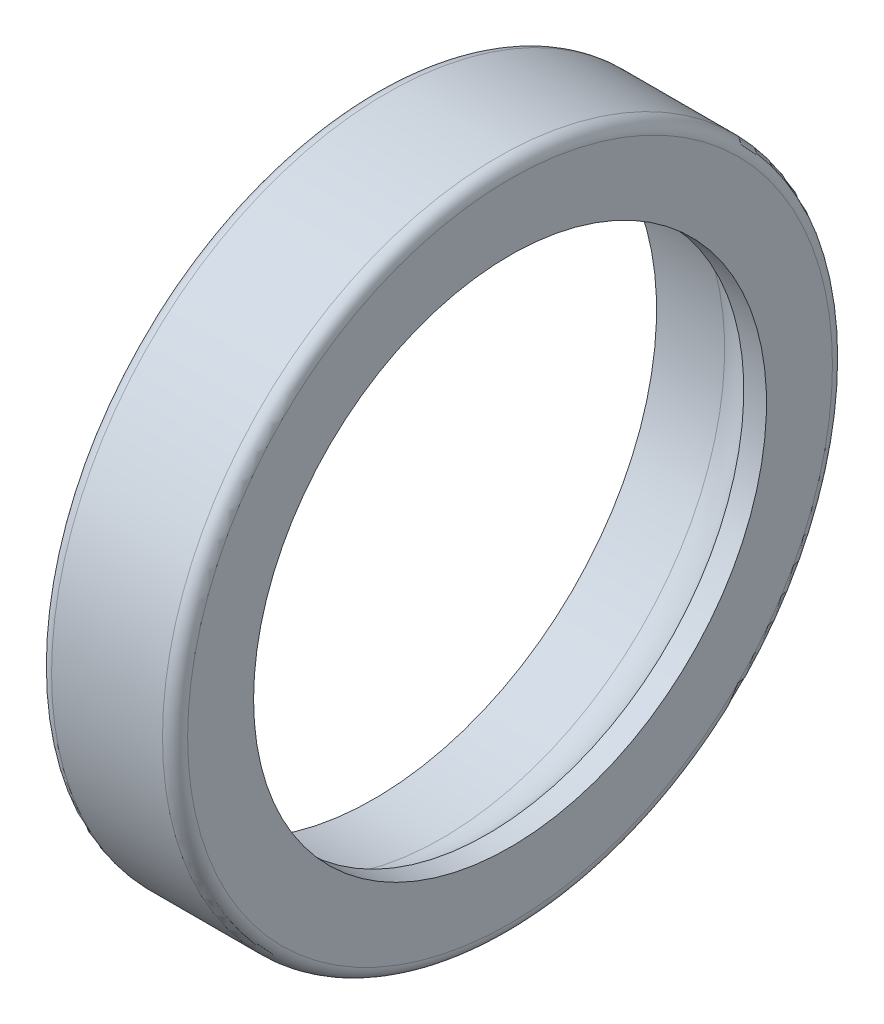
ISO-10303-21;
HEADER;
FILE_DESCRIPTION(('STEP AP214'),'2;1');
FILE_NAME('part.step','',(''),(''),'','','');
FILE_SCHEMA(('AUTOMOTIVE_DESIGN { 1 0 10303 214 1 1 1 1 }'));
ENDSEC;
DATA;
#1=APPLICATION_CONTEXT('core data for automotive mechanical design processes');
#2=APPLICATION_PROTOCOL_DEFINITION('international standard','automotive_design',2000,#1);
#3=PRODUCT_CONTEXT('',#1,'mechanical');
#4=PRODUCT('Part','Part','',(#3));
#5=PRODUCT_RELATED_PRODUCT_CATEGORY('part','',(#4));
#6=PRODUCT_DEFINITION_FORMATION('','',#4);
#7=PRODUCT_DEFINITION_CONTEXT('part definition',#1,'design');
#8=PRODUCT_DEFINITION('design','',#6,#7);
#9=PRODUCT_DEFINITION_SHAPE('','',#8);
#10=(LENGTH_UNIT() NAMED_UNIT(*) SI_UNIT(.MILLI.,.METRE.));
#11=(NAMED_UNIT(*) PLANE_ANGLE_UNIT() SI_UNIT($,.RADIAN.));
#12=(NAMED_UNIT(*) SI_UNIT($,.STERADIAN.) SOLID_ANGLE_UNIT());
#13=UNCERTAINTY_MEASURE_WITH_UNIT(LENGTH_MEASURE(1.E-05),#10,'distance_accuracy_value','');
#14=(GEOMETRIC_REPRESENTATION_CONTEXT(3) GLOBAL_UNCERTAINTY_ASSIGNED_CONTEXT((#13)) GLOBAL_UNIT_ASSIGNED_CONTEXT((#10,
#11,#12)) REPRESENTATION_CONTEXT('',''));
#15=CARTESIAN_POINT('',(0.,0.,0.));
#16=DIRECTION('',(0.,0.,1.));
#17=DIRECTION('',(1.,0.,0.));
#18=AXIS2_PLACEMENT_3D('',#15,#16,#17);
#19=CARTESIAN_POINT('',(5.,0.,0.));
#20=DIRECTION('',(-1.,0.,0.));
#21=DIRECTION('',(0.,0.,1.));
#22=AXIS2_PLACEMENT_3D('',#19,#20,#21);
#23=TOROIDAL_SURFACE('',#22,11.,2.5);
#24=CARTESIAN_POINT('',(7.1650635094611,0.,0.));
#25=DIRECTION('',(-1.,0.,0.));
#26=DIRECTION('',(0.,0.,1.));
#27=AXIS2_PLACEMENT_3D('',#24,#25,#26);
#28=CIRCLE('',#27,12.25);
#29=CARTESIAN_POINT('',(7.1650635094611,0.,12.25));
#30=VERTEX_POINT('',#29);
#31=EDGE_CURVE('E10',#30,#30,#28,.T.);
#32=ORIENTED_EDGE('',*,*,#31,.F.);
#33=EDGE_LOOP('',(#32));
#34=FACE_BOUND('',#33,.T.);
#35=CARTESIAN_POINT('',(5.,0.,0.));
#36=DIRECTION('',(-1.,0.,0.));
#37=DIRECTION('',(0.,0.,1.));
#38=AXIS2_PLACEMENT_3D('',#35,#36,#37);
#39=CIRCLE('',#38,13.5);
#40=CARTESIAN_POINT('',(5.,0.,13.5));
#41=VERTEX_POINT('',#40);
#42=EDGE_CURVE('E57',#41,#41,#39,.T.);
#43=ORIENTED_EDGE('',*,*,#42,.T.);
#44=EDGE_LOOP('',(#43));
#45=FACE_BOUND('',#44,.T.);
#46=ADVANCED_FACE('F29',(#34,#45),#23,.F.);
#47=CARTESIAN_POINT('',(0.,0.,0.));
#48=DIRECTION('',(-1.,0.,0.));
#49=DIRECTION('',(0.,0.,1.));
#50=AXIS2_PLACEMENT_3D('',#47,#48,#49);
#51=CYLINDRICAL_SURFACE('',#50,12.25);
#52=CARTESIAN_POINT('',(8.25,0.,0.));
#53=DIRECTION('',(-1.,0.,0.));
#54=DIRECTION('',(0.,0.,1.));
#55=AXIS2_PLACEMENT_3D('',#52,#53,#54);
#56=CIRCLE('',#55,12.25);
#57=CARTESIAN_POINT('',(8.25,0.,12.25));
#58=VERTEX_POINT('',#57);
#59=EDGE_CURVE('E35',#58,#58,#56,.T.);
#60=ORIENTED_EDGE('',*,*,#59,.F.);
#61=EDGE_LOOP('',(#60));
#62=FACE_BOUND('',#61,.T.);
#63=ORIENTED_EDGE('',*,*,#31,.T.);
#64=EDGE_LOOP('',(#63));
#65=FACE_BOUND('',#64,.T.);
#66=ADVANCED_FACE('F94',(#62,#65),#51,.F.);
#67=CARTESIAN_POINT('',(8.25,0.,-15.4));
#68=DIRECTION('',(-1.,0.,0.));
#69=DIRECTION('',(0.,0.,1.));
#70=AXIS2_PLACEMENT_3D('',#67,#68,#69);
#71=PLANE('',#70);
#72=CARTESIAN_POINT('',(8.25,0.,0.));
#73=DIRECTION('',(-1.,0.,0.));
#74=DIRECTION('',(0.,0.,1.));
#75=AXIS2_PLACEMENT_3D('',#72,#73,#74);
#76=CIRCLE('',#75,15.4);
#77=CARTESIAN_POINT('',(8.25,0.,15.4));
#78=VERTEX_POINT('',#77);
#79=EDGE_CURVE('E39',#78,#78,#76,.T.);
#80=ORIENTED_EDGE('',*,*,#79,.F.);
#81=EDGE_LOOP('',(#80));
#82=FACE_BOUND('',#81,.T.);
#83=ORIENTED_EDGE('',*,*,#59,.T.);
#84=EDGE_LOOP('',(#83));
#85=FACE_BOUND('',#84,.T.);
#86=ADVANCED_FACE('F89',(#82,#85),#71,.F.);
#87=CARTESIAN_POINT('',(7.65,0.,0.));
#88=DIRECTION('',(-1.,0.,0.));
#89=DIRECTION('',(0.,0.,1.));
#90=AXIS2_PLACEMENT_3D('',#87,#88,#89);
#91=TOROIDAL_SURFACE('',#90,15.4,0.6);
#92=CARTESIAN_POINT('',(7.65,0.,0.));
#93=DIRECTION('',(-1.,0.,0.));
#94=DIRECTION('',(0.,0.,1.));
#95=AXIS2_PLACEMENT_3D('',#92,#93,#94);
#96=CIRCLE('',#95,16.);
#97=CARTESIAN_POINT('',(7.65,0.,16.));
#98=VERTEX_POINT('',#97);
#99=EDGE_CURVE('E43',#98,#98,#96,.T.);
#100=ORIENTED_EDGE('',*,*,#99,.F.);
#101=EDGE_LOOP('',(#100));
#102=FACE_BOUND('',#101,.T.);
#103=ORIENTED_EDGE('',*,*,#79,.T.);
#104=EDGE_LOOP('',(#103));
#105=FACE_BOUND('',#104,.T.);
#106=ADVANCED_FACE('F83',(#102,#105),#91,.T.);
#107=CARTESIAN_POINT('',(0.,0.,0.));
#108=DIRECTION('',(-1.,0.,0.));
#109=DIRECTION('',(0.,0.,1.));
#110=AXIS2_PLACEMENT_3D('',#107,#108,#109);
#111=CYLINDRICAL_SURFACE('',#110,16.);
#112=CARTESIAN_POINT('',(2.35000000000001,0.,0.));
#113=DIRECTION('',(-1.,0.,0.));
#114=DIRECTION('',(0.,0.,1.));
#115=AXIS2_PLACEMENT_3D('',#112,#113,#114);
#116=CIRCLE('',#115,16.);
#117=CARTESIAN_POINT('',(2.35000000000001,0.,16.));
#118=VERTEX_POINT('',#117);
#119=EDGE_CURVE('E48',#118,#118,#116,.T.);
#120=ORIENTED_EDGE('',*,*,#119,.F.);
#121=EDGE_LOOP('',(#120));
#122=FACE_BOUND('',#121,.T.);
#123=ORIENTED_EDGE('',*,*,#99,.T.);
#124=EDGE_LOOP('',(#123));
#125=FACE_BOUND('',#124,.T.);
#126=ADVANCED_FACE('F77',(#122,#125),#111,.T.);
#127=CARTESIAN_POINT('',(2.35,0.,0.));
#128=DIRECTION('',(-1.,0.,0.));
#129=DIRECTION('',(0.,0.,1.));
#130=AXIS2_PLACEMENT_3D('',#127,#128,#129);
#131=TOROIDAL_SURFACE('',#130,15.4,0.6);
#132=CARTESIAN_POINT('',(1.75,0.,0.));
#133=DIRECTION('',(-1.,0.,0.));
#134=DIRECTION('',(0.,0.,1.));
#135=AXIS2_PLACEMENT_3D('',#132,#133,#134);
#136=CIRCLE('',#135,15.4);
#137=CARTESIAN_POINT('',(1.75,0.,15.4));
#138=VERTEX_POINT('',#137);
#139=EDGE_CURVE('E51',#138,#138,#136,.T.);
#140=ORIENTED_EDGE('',*,*,#139,.F.);
#141=EDGE_LOOP('',(#140));
#142=FACE_BOUND('',#141,.T.);
#143=ORIENTED_EDGE('',*,*,#119,.T.);
#144=EDGE_LOOP('',(#143));
#145=FACE_BOUND('',#144,.T.);
#146=ADVANCED_FACE('F71',(#142,#145),#131,.T.);
#147=CARTESIAN_POINT('',(1.75,0.,-15.4));
#148=DIRECTION('',(1.,0.,0.));
#149=DIRECTION('',(0.,0.,-1.));
#150=AXIS2_PLACEMENT_3D('',#147,#148,#149);
#151=PLANE('',#150);
#152=CARTESIAN_POINT('',(1.75,0.,0.));
#153=DIRECTION('',(-1.,0.,0.));
#154=DIRECTION('',(0.,0.,1.));
#155=AXIS2_PLACEMENT_3D('',#152,#153,#154);
#156=CIRCLE('',#155,13.5);
#157=CARTESIAN_POINT('',(1.75,0.,13.5));
#158=VERTEX_POINT('',#157);
#159=EDGE_CURVE('E54',#158,#158,#156,.T.);
#160=ORIENTED_EDGE('',*,*,#159,.F.);
#161=EDGE_LOOP('',(#160));
#162=FACE_BOUND('',#161,.T.);
#163=ORIENTED_EDGE('',*,*,#139,.T.);
#164=EDGE_LOOP('',(#163));
#165=FACE_BOUND('',#164,.T.);
#166=ADVANCED_FACE('F65',(#162,#165),#151,.F.);
#167=CARTESIAN_POINT('',(0.,0.,0.));
#168=DIRECTION('',(-1.,0.,0.));
#169=DIRECTION('',(0.,0.,1.));
#170=AXIS2_PLACEMENT_3D('',#167,#168,#169);
#171=CYLINDRICAL_SURFACE('',#170,13.5);
#172=ORIENTED_EDGE('',*,*,#42,.F.);
#173=EDGE_LOOP('',(#172));
#174=FACE_BOUND('',#173,.T.);
#175=ORIENTED_EDGE('',*,*,#159,.T.);
#176=EDGE_LOOP('',(#175));
#177=FACE_BOUND('',#176,.T.);
#178=ADVANCED_FACE('F62',(#174,#177),#171,.F.);
#179=CLOSED_SHELL('',(#46,#66,#86,#106,#126,#146,#166,#178));
#180=MANIFOLD_SOLID_BREP('B2',#179);
#181=ADVANCED_BREP_SHAPE_REPRESENTATION('',(#18,#180),#14);
#182=SHAPE_DEFINITION_REPRESENTATION(#9,#181);
ENDSEC;
END-ISO-10303-21;
